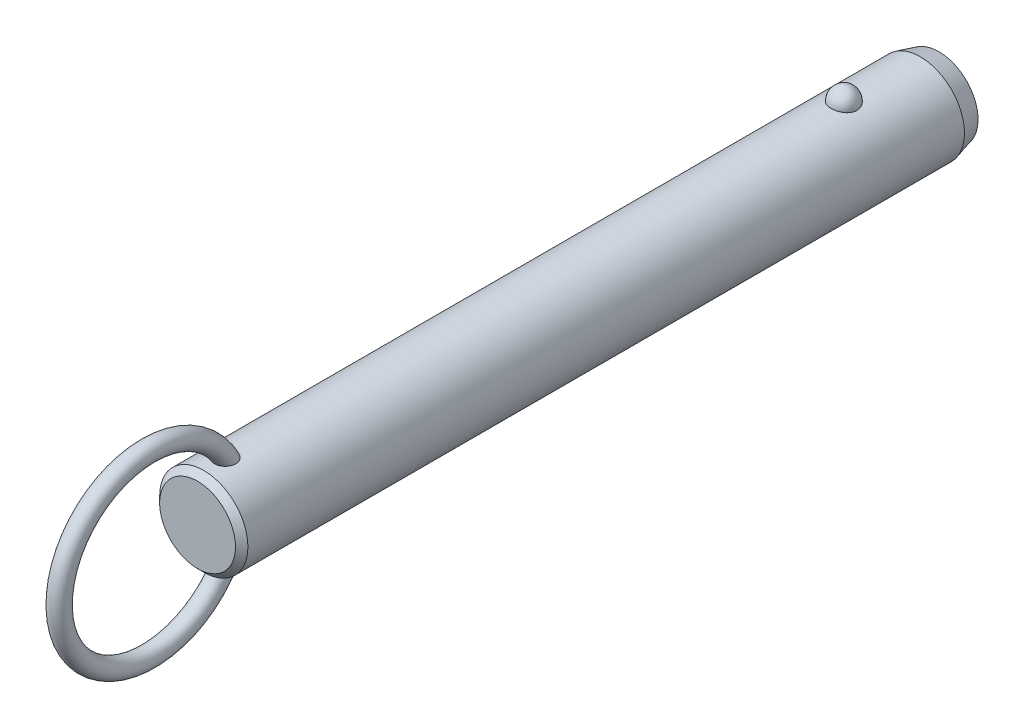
ISO-10303-21;
HEADER;
FILE_DESCRIPTION(('STEP AP214'),'2;1');
FILE_NAME('part.step','',(''),(''),'','','');
FILE_SCHEMA(('AUTOMOTIVE_DESIGN { 1 0 10303 214 1 1 1 1 }'));
ENDSEC;
DATA;
#1=APPLICATION_CONTEXT('core data for automotive mechanical design processes');
#2=APPLICATION_PROTOCOL_DEFINITION('international standard','automotive_design',2000,#1);
#3=PRODUCT_CONTEXT('',#1,'mechanical');
#4=PRODUCT('Part','Part','',(#3));
#5=PRODUCT_RELATED_PRODUCT_CATEGORY('part','',(#4));
#6=PRODUCT_DEFINITION_FORMATION('','',#4);
#7=PRODUCT_DEFINITION_CONTEXT('part definition',#1,'design');
#8=PRODUCT_DEFINITION('design','',#6,#7);
#9=PRODUCT_DEFINITION_SHAPE('','',#8);
#10=(LENGTH_UNIT() NAMED_UNIT(*) SI_UNIT(.MILLI.,.METRE.));
#11=(NAMED_UNIT(*) PLANE_ANGLE_UNIT() SI_UNIT($,.RADIAN.));
#12=(NAMED_UNIT(*) SI_UNIT($,.STERADIAN.) SOLID_ANGLE_UNIT());
#13=UNCERTAINTY_MEASURE_WITH_UNIT(LENGTH_MEASURE(1.E-05),#10,'distance_accuracy_value','');
#14=(GEOMETRIC_REPRESENTATION_CONTEXT(3) GLOBAL_UNCERTAINTY_ASSIGNED_CONTEXT((#13)) GLOBAL_UNIT_ASSIGNED_CONTEXT((#10,
#11,#12)) REPRESENTATION_CONTEXT('',''));
#15=CARTESIAN_POINT('',(0.,0.,0.));
#16=DIRECTION('',(0.,0.,1.));
#17=DIRECTION('',(1.,0.,0.));
#18=AXIS2_PLACEMENT_3D('',#15,#16,#17);
#19=CARTESIAN_POINT('',(0.,0.,94.));
#20=DIRECTION('',(0.,0.,-1.));
#21=DIRECTION('',(-1.,0.,0.));
#22=AXIS2_PLACEMENT_3D('',#19,#20,#21);
#23=CYLINDRICAL_SURFACE('',#22,7.1);
#24=CARTESIAN_POINT('',(2.0769088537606,6.78943661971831,-2.1));
#25=CARTESIAN_POINT('',(2.07690739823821,6.78943796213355,-1.98268154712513));
#26=CARTESIAN_POINT('',(2.06738130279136,6.79237331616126,-1.86534506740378));
#27=CARTESIAN_POINT('',(2.0295040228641,6.8037853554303,-1.63400788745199));
#28=CARTESIAN_POINT('',(2.00114757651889,6.81226358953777,-1.52000812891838));
#29=CARTESIAN_POINT('',(1.92632025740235,6.83379798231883,-1.29863433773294));
#30=CARTESIAN_POINT('',(1.87985726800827,6.84685214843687,-1.19125744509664));
#31=CARTESIAN_POINT('',(1.76995205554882,6.87608091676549,-0.98604657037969));
#32=CARTESIAN_POINT('',(1.70650980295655,6.8922555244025,-0.88821260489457));
#33=CARTESIAN_POINT('',(1.5638119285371,6.92602930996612,-0.704242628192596));
#34=CARTESIAN_POINT('',(1.4844714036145,6.94363582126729,-0.618173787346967));
#35=CARTESIAN_POINT('',(1.31221746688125,6.97823658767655,-0.460740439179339));
#36=CARTESIAN_POINT('',(1.21930409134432,6.99523084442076,-0.389375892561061));
#37=CARTESIAN_POINT('',(1.02268781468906,7.02666176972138,-0.263547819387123));
#38=CARTESIAN_POINT('',(0.91902009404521,7.04110638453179,-0.209031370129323));
#39=CARTESIAN_POINT('',(0.703548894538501,7.06588726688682,-0.118163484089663));
#40=CARTESIAN_POINT('',(0.591746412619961,7.07622403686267,-0.0818098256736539));
#41=CARTESIAN_POINT('',(0.365557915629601,7.09147068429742,-0.0288711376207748));
#42=CARTESIAN_POINT('',(0.251267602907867,7.09648447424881,-0.0119070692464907));
#43=CARTESIAN_POINT('',(0.0213499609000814,7.10089837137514,0.00304925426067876));
#44=CARTESIAN_POINT('',(-0.0942772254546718,7.10029907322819,0.00104351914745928));
#45=CARTESIAN_POINT('',(-0.321651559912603,7.09360829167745,-0.0216931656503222));
#46=CARTESIAN_POINT('',(-0.433431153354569,7.08760388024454,-0.0421272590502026));
#47=CARTESIAN_POINT('',(-0.651862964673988,7.07086131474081,-0.100729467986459));
#48=CARTESIAN_POINT('',(-0.758515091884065,7.06012307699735,-0.138897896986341));
#49=CARTESIAN_POINT('',(-0.964449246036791,7.03496097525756,-0.232213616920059));
#50=CARTESIAN_POINT('',(-1.06368095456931,7.02051445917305,-0.287465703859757));
#51=CARTESIAN_POINT('',(-1.25145353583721,6.98948740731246,-0.413383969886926));
#52=CARTESIAN_POINT('',(-1.33999321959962,6.97290663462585,-0.48405186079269));
#53=CARTESIAN_POINT('',(-1.50591604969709,6.93898770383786,-0.640594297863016));
#54=CARTESIAN_POINT('',(-1.58302488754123,6.92164094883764,-0.726757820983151));
#55=CARTESIAN_POINT('',(-1.72189320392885,6.8884103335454,-0.91092752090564));
#56=CARTESIAN_POINT('',(-1.78365144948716,6.87252659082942,-1.008934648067));
#57=CARTESIAN_POINT('',(-1.89101272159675,6.84377189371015,-1.21549497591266));
#58=CARTESIAN_POINT('',(-1.93639553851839,6.83094274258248,-1.32416860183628));
#59=CARTESIAN_POINT('',(-2.00874275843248,6.81002070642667,-1.54791500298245));
#60=CARTESIAN_POINT('',(-2.03570774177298,6.80192767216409,-1.66298757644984));
#61=CARTESIAN_POINT('',(-2.07047276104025,6.7914266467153,-1.89571453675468));
#62=CARTESIAN_POINT('',(-2.07835878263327,6.78899315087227,-2.01335491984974));
#63=CARTESIAN_POINT('',(-2.07502083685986,6.79001409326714,-2.24833570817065));
#64=CARTESIAN_POINT('',(-2.06379746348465,6.7934683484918,-2.36567612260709));
#65=CARTESIAN_POINT('',(-2.02263913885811,6.80583442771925,-2.59603194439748));
#66=CARTESIAN_POINT('',(-1.99281127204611,6.81471501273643,-2.70906820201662));
#67=CARTESIAN_POINT('',(-1.91526639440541,6.83691232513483,-2.92836575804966));
#68=CARTESIAN_POINT('',(-1.8675486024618,6.85022924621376,-3.03462676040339));
#69=CARTESIAN_POINT('',(-1.75504492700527,6.87991336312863,-3.23806487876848));
#70=CARTESIAN_POINT('',(-1.69015924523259,6.89629822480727,-3.33518422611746));
#71=CARTESIAN_POINT('',(-1.54505404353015,6.93024852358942,-3.51697105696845));
#72=CARTESIAN_POINT('',(-1.46483385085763,6.94781401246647,-3.60163799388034));
#73=CARTESIAN_POINT('',(-1.29071406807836,6.98225977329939,-3.75654119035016));
#74=CARTESIAN_POINT('',(-1.19675650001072,6.99913673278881,-3.82671308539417));
#75=CARTESIAN_POINT('',(-0.997940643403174,7.03023618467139,-3.9501837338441));
#76=CARTESIAN_POINT('',(-0.89308318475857,7.04445887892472,-4.00348377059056));
#77=CARTESIAN_POINT('',(-0.676902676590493,7.06848365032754,-4.09107242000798));
#78=CARTESIAN_POINT('',(-0.565686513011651,7.0783430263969,-4.12560889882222));
#79=CARTESIAN_POINT('',(-0.338739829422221,7.09282534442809,-4.17575450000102));
#80=CARTESIAN_POINT('',(-0.223009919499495,7.09744899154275,-4.19136617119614));
#81=CARTESIAN_POINT('',(0.00707628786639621,7.10090930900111,-4.20307965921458));
#82=CARTESIAN_POINT('',(0.121410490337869,7.09986531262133,-4.19958377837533));
#83=CARTESIAN_POINT('',(0.347815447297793,7.092380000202,-4.17411564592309));
#84=CARTESIAN_POINT('',(0.459886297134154,7.08593891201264,-4.15214417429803));
#85=CARTESIAN_POINT('',(0.678084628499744,7.06838983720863,-4.09049562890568));
#86=CARTESIAN_POINT('',(0.784237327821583,7.05730369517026,-4.05090137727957));
#87=CARTESIAN_POINT('',(0.988305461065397,7.03163139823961,-3.95511447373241));
#88=CARTESIAN_POINT('',(1.08622031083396,7.01704499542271,-3.89892064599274));
#89=CARTESIAN_POINT('',(1.27284490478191,6.98562668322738,-3.77035541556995));
#90=CARTESIAN_POINT('',(1.36137372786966,6.96876135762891,-3.69772964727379));
#91=CARTESIAN_POINT('',(1.52509486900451,6.93477412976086,-3.53878279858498));
#92=CARTESIAN_POINT('',(1.60028496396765,6.91765218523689,-3.45245943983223));
#93=CARTESIAN_POINT('',(1.73681688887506,6.88465753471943,-3.26658774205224));
#94=CARTESIAN_POINT('',(1.79785966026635,6.86881574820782,-3.16681408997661));
#95=CARTESIAN_POINT('',(1.90265327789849,6.84053157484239,-2.95814408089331));
#96=CARTESIAN_POINT('',(1.94640861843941,6.82808830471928,-2.84925010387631));
#97=CARTESIAN_POINT('',(2.01274378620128,6.80881460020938,-2.63454318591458));
#98=CARTESIAN_POINT('',(2.03676193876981,6.80160856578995,-2.52920574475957));
#99=CARTESIAN_POINT('',(2.06884490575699,6.79191902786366,-2.3159172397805));
#100=CARTESIAN_POINT('',(2.07691019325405,6.78943538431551,-2.20796625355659));
#101=CARTESIAN_POINT('',(2.0769088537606,6.78943661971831,-2.1));
#102=B_SPLINE_CURVE_WITH_KNOTS('',3,(#24,#25,#26,#27,#28,#29,#30,#31,#32,#33,#34,#35,#36,#37,
#38,#39,#40,#41,#42,#43,#44,#45,#46,#47,#48,#49,#50,#51,#52,#53,#54,#55,#56,#57,#58,#59,#60,#61,
#62,#63,#64,#65,#66,#67,#68,#69,#70,#71,#72,#73,#74,#75,#76,#77,#78,#79,#80,#81,#82,#83,#84,#85,
#86,#87,#88,#89,#90,#91,#92,#93,#94,#95,#96,#97,#98,#99,#100,#101),.UNSPECIFIED.,.T.,.F.,(4,2,2,
2,2,2,2,2,2,2,2,2,2,2,2,2,2,2,2,2,2,2,2,2,2,2,2,2,2,2,2,2,2,2,2,2,2,2,4),(0.,0.351568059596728,
0.703234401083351,1.05474780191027,1.40626181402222,1.75970563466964,2.11314851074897,
2.4654696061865,2.81774759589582,3.16301449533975,3.50824481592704,3.84801136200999,
4.18778391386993,4.52968352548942,4.87162112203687,5.22076181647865,5.56993054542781,
5.92363364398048,6.27732559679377,6.62942052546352,6.98150450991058,7.33158042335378,
7.68167162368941,8.03384443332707,8.38603269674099,8.73975272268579,9.09344583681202,
9.44234545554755,9.79119807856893,10.1327344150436,10.4742563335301,10.8141898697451,
11.1541474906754,11.4997793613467,11.8454687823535,12.1979079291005,12.5502553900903,
12.8738073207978,13.1973496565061),.UNSPECIFIED.);
#103=CARTESIAN_POINT('',(2.0769088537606,6.78943661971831,-2.1));
#104=VERTEX_POINT('',#103);
#105=EDGE_CURVE('E41',#104,#104,#102,.T.);
#106=ORIENTED_EDGE('',*,*,#105,.T.);
#107=EDGE_LOOP('',(#106));
#108=FACE_BOUND('',#107,.T.);
#109=CARTESIAN_POINT('',(0.,0.,100.92));
#110=DIRECTION('',(0.,0.,1.));
#111=DIRECTION('',(1.,0.,0.));
#112=AXIS2_PLACEMENT_3D('',#109,#110,#111);
#113=CIRCLE('',#112,7.1);
#114=CARTESIAN_POINT('',(7.1,0.,100.92));
#115=VERTEX_POINT('',#114);
#116=EDGE_CURVE('E10',#115,#115,#113,.F.);
#117=ORIENTED_EDGE('',*,*,#116,.T.);
#118=EDGE_LOOP('',(#117));
#119=FACE_BOUND('',#118,.T.);
#120=CARTESIAN_POINT('',(-0.429539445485,-7.08699541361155,95.7429212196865));
#121=CARTESIAN_POINT('',(-0.508331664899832,-7.08221999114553,95.7668764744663));
#122=CARTESIAN_POINT('',(-0.58503984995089,-7.07624016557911,95.7974570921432));
#123=CARTESIAN_POINT('',(-0.732082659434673,-7.06254296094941,95.8710242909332));
#124=CARTESIAN_POINT('',(-0.802417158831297,-7.05482554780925,95.9140111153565));
#125=CARTESIAN_POINT('',(-0.934722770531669,-7.03851844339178,96.0111135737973));
#126=CARTESIAN_POINT('',(-0.99670020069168,-7.02992941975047,96.0652207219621));
#127=CARTESIAN_POINT('',(-1.11079942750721,-7.01280697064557,96.1829676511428));
#128=CARTESIAN_POINT('',(-1.16292136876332,-7.00427354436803,96.2466072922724));
#129=CARTESIAN_POINT('',(-1.25705660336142,-6.98799959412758,96.3826870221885));
#130=CARTESIAN_POINT('',(-1.29888032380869,-6.98027525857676,96.4552598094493));
#131=CARTESIAN_POINT('',(-1.37069920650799,-6.96652886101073,96.6061686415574));
#132=CARTESIAN_POINT('',(-1.40069157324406,-6.96050720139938,96.6845060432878));
#133=CARTESIAN_POINT('',(-1.45043507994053,-6.95031881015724,96.8501903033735));
#134=CARTESIAN_POINT('',(-1.46937115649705,-6.94630231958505,96.9377897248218));
#135=CARTESIAN_POINT('',(-1.49424917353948,-6.94099239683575,97.1148714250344));
#136=CARTESIAN_POINT('',(-1.50018601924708,-6.93970003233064,97.2043544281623));
#137=CARTESIAN_POINT('',(-1.49978214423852,-6.93978815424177,97.3940607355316));
#138=CARTESIAN_POINT('',(-1.49187639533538,-6.94150934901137,97.494279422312));
#139=CARTESIAN_POINT('',(-1.46177925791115,-6.94790814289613,97.6924798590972));
#140=CARTESIAN_POINT('',(-1.43957541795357,-6.95258831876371,97.790459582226));
#141=CARTESIAN_POINT('',(-1.37783293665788,-6.96510647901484,97.9953629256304));
#142=CARTESIAN_POINT('',(-1.33634073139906,-6.97328848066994,98.1016801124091));
#143=CARTESIAN_POINT('',(-1.23686994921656,-6.99161706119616,98.3061777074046));
#144=CARTESIAN_POINT('',(-1.17889192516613,-7.00176357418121,98.4043583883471));
#145=CARTESIAN_POINT('',(-1.0587512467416,-7.02082898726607,98.5723743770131));
#146=CARTESIAN_POINT('',(-0.999247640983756,-7.02963746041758,98.6441230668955));
#147=CARTESIAN_POINT('',(-0.869494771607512,-7.04686074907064,98.7771959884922));
#148=CARTESIAN_POINT('',(-0.799263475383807,-7.05527619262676,98.8385372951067));
#149=CARTESIAN_POINT('',(-0.665408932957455,-7.06899457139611,98.9351316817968));
#150=CARTESIAN_POINT('',(-0.603817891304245,-7.07457275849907,98.9731512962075));
#151=CARTESIAN_POINT('',(-0.47517283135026,-7.08437420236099,99.0387581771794));
#152=CARTESIAN_POINT('',(-0.408123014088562,-7.08859848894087,99.0663533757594));
#153=CARTESIAN_POINT('',(-0.269431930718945,-7.09522749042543,99.1092569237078));
#154=CARTESIAN_POINT('',(-0.197757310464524,-7.09761688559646,99.1244618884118));
#155=CARTESIAN_POINT('',(-0.0527849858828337,-7.10017268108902,99.1407168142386));
#156=CARTESIAN_POINT('',(0.0205115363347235,-7.10034065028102,99.1417767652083));
#157=CARTESIAN_POINT('',(0.156426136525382,-7.09855986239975,99.1304619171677));
#158=CARTESIAN_POINT('',(0.219199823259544,-7.09688191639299,99.1198060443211));
#159=CARTESIAN_POINT('',(0.342134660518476,-7.09201880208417,99.0885379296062));
#160=CARTESIAN_POINT('',(0.402295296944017,-7.08883333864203,99.0679237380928));
#161=CARTESIAN_POINT('',(0.520687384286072,-7.08113868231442,99.0172125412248));
#162=CARTESIAN_POINT('',(0.578791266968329,-7.07658958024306,98.9868272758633));
#163=CARTESIAN_POINT('',(0.690173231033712,-7.06659708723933,98.9183678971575));
#164=CARTESIAN_POINT('',(0.743447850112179,-7.061153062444,98.8802883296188));
#165=CARTESIAN_POINT('',(0.870947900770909,-7.04680292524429,98.7765929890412));
#166=CARTESIAN_POINT('',(0.941828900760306,-7.0375580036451,98.7068972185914));
#167=CARTESIAN_POINT('',(1.07136606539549,-7.01900793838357,98.5569450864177));
#168=CARTESIAN_POINT('',(1.13000013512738,-7.00970271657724,98.4766700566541));
#169=CARTESIAN_POINT('',(1.23579584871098,-6.99183327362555,98.3068997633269));
#170=CARTESIAN_POINT('',(1.2827427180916,-6.98328455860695,98.2172696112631));
#171=CARTESIAN_POINT('',(1.36351442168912,-6.96796352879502,98.0321763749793));
#172=CARTESIAN_POINT('',(1.39733971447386,-6.96119115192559,97.9367134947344));
#173=CARTESIAN_POINT('',(1.45579181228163,-6.94922464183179,97.7253092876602));
#174=CARTESIAN_POINT('',(1.47790145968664,-6.94449000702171,97.608631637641));
#175=CARTESIAN_POINT('',(1.50168752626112,-6.93938731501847,97.3730153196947));
#176=CARTESIAN_POINT('',(1.50336085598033,-6.93901991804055,97.2540763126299));
#177=CARTESIAN_POINT('',(1.48486516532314,-6.9430010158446,97.0236079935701));
#178=CARTESIAN_POINT('',(1.46573441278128,-6.9471253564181,96.911995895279));
#179=CARTESIAN_POINT('',(1.40606892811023,-6.95944667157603,96.6948868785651));
#180=CARTESIAN_POINT('',(1.36556446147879,-6.96763788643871,96.5893815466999));
#181=CARTESIAN_POINT('',(1.27082700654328,-6.98548038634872,96.4042879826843));
#182=CARTESIAN_POINT('',(1.21949810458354,-6.99473841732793,96.3231719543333));
#183=CARTESIAN_POINT('',(1.10242050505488,-7.01414069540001,96.1722278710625));
#184=CARTESIAN_POINT('',(1.03668119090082,-7.02428436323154,96.1023925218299));
#185=CARTESIAN_POINT('',(0.900559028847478,-7.04295285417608,95.9835735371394));
#186=CARTESIAN_POINT('',(0.83142884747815,-7.05153466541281,95.9331573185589));
#187=CARTESIAN_POINT('',(0.68529187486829,-7.06723150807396,95.8451429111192));
#188=CARTESIAN_POINT('',(0.608287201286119,-7.0743469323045,95.8075412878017));
#189=CARTESIAN_POINT('',(0.451878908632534,-7.08602232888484,95.7474915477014));
#190=CARTESIAN_POINT('',(0.372686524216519,-7.09067127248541,95.7245088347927));
#191=CARTESIAN_POINT('',(0.211477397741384,-7.09730788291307,95.6920357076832));
#192=CARTESIAN_POINT('',(0.129460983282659,-7.09929585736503,95.6825437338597));
#193=CARTESIAN_POINT('',(-0.0332905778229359,-7.10037858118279,95.6773517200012));
#194=CARTESIAN_POINT('',(-0.114016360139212,-7.09953334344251,95.6813656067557));
#195=CARTESIAN_POINT('',(-0.273670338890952,-7.09517338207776,95.7024540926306));
#196=CARTESIAN_POINT('',(-0.352598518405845,-7.09165863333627,95.7195288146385));
#197=CARTESIAN_POINT('',(-0.429539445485,-7.08699541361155,95.7429212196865));
#198=B_SPLINE_CURVE_WITH_KNOTS('',3,(#120,#121,#122,#123,#124,#125,#126,#127,#128,#129,#130,
#131,#132,#133,#134,#135,#136,#137,#138,#139,#140,#141,#142,#143,#144,#145,#146,#147,#148,#149,
#150,#151,#152,#153,#154,#155,#156,#157,#158,#159,#160,#161,#162,#163,#164,#165,#166,#167,#168,
#169,#170,#171,#172,#173,#174,#175,#176,#177,#178,#179,#180,#181,#182,#183,#184,#185,#186,#187,
#188,#189,#190,#191,#192,#193,#194,#195,#196,#197),.UNSPECIFIED.,.T.,.F.,(4,2,2,2,2,2,2,2,2,2,2,
2,2,2,2,2,2,2,2,2,2,2,2,2,2,2,2,2,2,2,2,2,2,2,2,2,2,2,4),(0.,0.247183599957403,
0.494372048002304,0.741372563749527,0.988369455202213,1.23962059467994,1.49093106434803,
1.75897818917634,2.02713035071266,2.32758265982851,2.62829697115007,2.97008736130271,
3.31186629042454,3.59175319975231,3.87117637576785,4.08813841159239,4.30493502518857,
4.52352259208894,4.74195577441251,4.9321532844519,5.12238804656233,5.31884850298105,
5.51544871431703,5.81332317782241,6.11173048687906,6.4152726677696,6.71880423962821,
7.07358156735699,7.42841252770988,7.76631485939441,8.10373999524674,8.39142246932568,
8.67891817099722,8.93560332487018,9.19221962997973,9.43881106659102,9.68537399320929,
9.92674752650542,10.1681233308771),.UNSPECIFIED.);
#199=CARTESIAN_POINT('',(-0.429539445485,-7.08699541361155,95.7429212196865));
#200=VERTEX_POINT('',#199);
#201=EDGE_CURVE('E59',#200,#200,#198,.T.);
#202=ORIENTED_EDGE('',*,*,#201,.T.);
#203=EDGE_LOOP('',(#202));
#204=FACE_BOUND('',#203,.T.);
#205=CARTESIAN_POINT('',(-0.429539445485,7.08699541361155,95.7429212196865));
#206=CARTESIAN_POINT('',(-0.351665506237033,7.09171429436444,95.7192469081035));
#207=CARTESIAN_POINT('',(-0.271733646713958,7.09525896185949,95.7020369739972));
#208=CARTESIAN_POINT('',(-0.110026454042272,7.09960839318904,95.6810059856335));
#209=CARTESIAN_POINT('',(-0.0282502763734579,7.10041187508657,95.677191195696));
#210=CARTESIAN_POINT('',(0.134782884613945,7.09918849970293,95.683059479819));
#211=CARTESIAN_POINT('',(0.21603995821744,7.09716214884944,95.6927401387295));
#212=CARTESIAN_POINT('',(0.375730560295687,7.09050177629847,95.7253471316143));
#213=CARTESIAN_POINT('',(0.454164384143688,7.08586802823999,95.7482720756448));
#214=CARTESIAN_POINT('',(0.60602533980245,7.07449911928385,95.806771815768));
#215=CARTESIAN_POINT('',(0.679451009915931,7.06776334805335,95.8423502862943));
#216=CARTESIAN_POINT('',(0.819234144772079,7.05292866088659,95.9251753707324));
#217=CARTESIAN_POINT('',(0.885591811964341,7.04482978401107,95.9724216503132));
#218=CARTESIAN_POINT('',(1.00993211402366,7.02808709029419,96.0775902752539));
#219=CARTESIAN_POINT('',(1.06785399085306,7.01943990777,96.135583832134));
#220=CARTESIAN_POINT('',(1.17342527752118,7.00256662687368,96.2603013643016));
#221=CARTESIAN_POINT('',(1.22107408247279,6.99434055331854,96.3270258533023));
#222=CARTESIAN_POINT('',(1.30652927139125,6.97889183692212,96.4693622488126));
#223=CARTESIAN_POINT('',(1.34399711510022,6.97170674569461,96.5451808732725));
#224=CARTESIAN_POINT('',(1.40682616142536,6.95930080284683,96.7018100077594));
#225=CARTESIAN_POINT('',(1.43218374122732,6.95408053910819,96.7826220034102));
#226=CARTESIAN_POINT('',(1.47246409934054,6.94566853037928,96.9535314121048));
#227=CARTESIAN_POINT('',(1.48642590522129,6.9426653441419,97.0438630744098));
#228=CARTESIAN_POINT('',(1.5011410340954,6.93949744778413,97.225619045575));
#229=CARTESIAN_POINT('',(1.50188917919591,6.93933385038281,97.3170437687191));
#230=CARTESIAN_POINT('',(1.49030464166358,6.94183245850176,97.5108438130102));
#231=CARTESIAN_POINT('',(1.47627413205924,6.94486147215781,97.613112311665));
#232=CARTESIAN_POINT('',(1.43356351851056,6.95380194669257,97.8144719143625));
#233=CARTESIAN_POINT('',(1.4048676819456,6.95971650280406,97.9135594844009));
#234=CARTESIAN_POINT('',(1.32908750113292,6.97461208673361,98.1189087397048));
#235=CARTESIAN_POINT('',(1.28011435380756,6.98388945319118,98.2244566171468));
#236=CARTESIAN_POINT('',(1.16520357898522,7.00397743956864,98.4257604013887));
#237=CARTESIAN_POINT('',(1.09927694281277,7.01478706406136,98.5215225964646));
#238=CARTESIAN_POINT('',(0.969361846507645,7.03373936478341,98.6767565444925));
#239=CARTESIAN_POINT('',(0.909042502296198,7.04187023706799,98.7393032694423));
#240=CARTESIAN_POINT('',(0.77917855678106,7.0574173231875,98.8540535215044));
#241=CARTESIAN_POINT('',(0.70964977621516,7.06483472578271,98.9062744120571));
#242=CARTESIAN_POINT('',(0.576854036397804,7.0767751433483,98.9881138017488));
#243=CARTESIAN_POINT('',(0.515118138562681,7.08158033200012,99.0201641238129));
#244=CARTESIAN_POINT('',(0.387127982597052,7.08972701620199,99.0737656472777));
#245=CARTESIAN_POINT('',(0.320877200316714,7.09306962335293,99.0953248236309));
#246=CARTESIAN_POINT('',(0.185041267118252,7.09791507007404,99.1264005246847));
#247=CARTESIAN_POINT('',(0.115437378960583,7.09940591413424,99.1358385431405));
#248=CARTESIAN_POINT('',(-0.0243157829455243,7.10030171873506,99.1415226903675));
#249=CARTESIAN_POINT('',(-0.0944648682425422,7.0997073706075,99.1377731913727));
#250=CARTESIAN_POINT('',(-0.225713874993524,7.09668414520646,99.1185081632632));
#251=CARTESIAN_POINT('',(-0.287006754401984,7.09444865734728,99.1042323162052));
#252=CARTESIAN_POINT('',(-0.40655537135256,7.08860360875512,99.0663685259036));
#253=CARTESIAN_POINT('',(-0.46480981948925,7.08499346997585,99.0427766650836));
#254=CARTESIAN_POINT('',(-0.594955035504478,7.07541654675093,98.9789232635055));
#255=CARTESIAN_POINT('',(-0.665389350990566,7.06906574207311,98.935753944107));
#256=CARTESIAN_POINT('',(-0.798242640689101,7.05530261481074,98.838587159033));
#257=CARTESIAN_POINT('',(-0.860645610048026,7.0478882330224,98.7845686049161));
#258=CARTESIAN_POINT('',(-0.994249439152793,7.03045217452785,98.6509965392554));
#259=CARTESIAN_POINT('',(-1.06260129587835,7.02030745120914,98.5686143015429));
#260=CARTESIAN_POINT('',(-1.18502045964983,7.00068382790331,98.393843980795));
#261=CARTESIAN_POINT('',(-1.23907684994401,6.99120544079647,98.301448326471));
#262=CARTESIAN_POINT('',(-1.33335589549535,6.97384343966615,98.1080085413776));
#263=CARTESIAN_POINT('',(-1.37336138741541,6.96598557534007,98.0068564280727));
#264=CARTESIAN_POINT('',(-1.43770677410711,6.9529905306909,97.7995046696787));
#265=CARTESIAN_POINT('',(-1.46204473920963,6.94785368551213,97.69330440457));
#266=CARTESIAN_POINT('',(-1.49537533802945,6.94076296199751,97.4682317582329));
#267=CARTESIAN_POINT('',(-1.50273564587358,6.93914842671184,97.3490975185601));
#268=CARTESIAN_POINT('',(-1.4954555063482,6.94072368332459,97.1114703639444));
#269=CARTESIAN_POINT('',(-1.48082914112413,6.94391040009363,96.9929770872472));
#270=CARTESIAN_POINT('',(-1.43076401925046,6.95438579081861,96.7734325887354));
#271=CARTESIAN_POINT('',(-1.39762227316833,6.96121852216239,96.6718413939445));
#272=CARTESIAN_POINT('',(-1.31211274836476,6.97783941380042,96.4773513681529));
#273=CARTESIAN_POINT('',(-1.2597660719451,6.98762432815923,96.3844431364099));
#274=CARTESIAN_POINT('',(-1.14583073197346,7.00713153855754,96.2241601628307));
#275=CARTESIAN_POINT('',(-1.0866594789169,7.01665982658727,96.1550351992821));
#276=CARTESIAN_POINT('',(-0.956606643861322,7.03556646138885,96.0288786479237));
#277=CARTESIAN_POINT('',(-0.885737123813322,7.04494495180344,95.9718347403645));
#278=CARTESIAN_POINT('',(-0.751558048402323,7.06035735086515,95.8831004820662));
#279=CARTESIAN_POINT('',(-0.690120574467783,7.0666695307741,95.8485932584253));
#280=CARTESIAN_POINT('',(-0.56281546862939,7.07794609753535,95.7887507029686));
#281=CARTESIAN_POINT('',(-0.496948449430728,7.08291067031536,95.7634141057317));
#282=CARTESIAN_POINT('',(-0.429539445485,7.08699541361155,95.7429212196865));
#283=B_SPLINE_CURVE_WITH_KNOTS('',3,(#205,#206,#207,#208,#209,#210,#211,#212,#213,#214,#215,
#216,#217,#218,#219,#220,#221,#222,#223,#224,#225,#226,#227,#228,#229,#230,#231,#232,#233,#234,
#235,#236,#237,#238,#239,#240,#241,#242,#243,#244,#245,#246,#247,#248,#249,#250,#251,#252,#253,
#254,#255,#256,#257,#258,#259,#260,#261,#262,#263,#264,#265,#266,#267,#268,#269,#270,#271,#272,
#273,#274,#275,#276,#277,#278,#279,#280,#281,#282),.UNSPECIFIED.,.T.,.F.,(4,2,2,2,2,2,2,2,2,2,2,
2,2,2,2,2,2,2,2,2,2,2,2,2,2,2,2,2,2,2,2,2,2,2,2,2,2,2,4),(0.,0.244335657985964,
0.488785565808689,0.733191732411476,0.977572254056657,1.22202379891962,1.46646834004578,
1.71259457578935,1.95873529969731,2.21226768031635,2.46587585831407,2.7391381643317,
3.01250754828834,3.32109936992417,3.63002293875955,3.97863512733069,4.32702187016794,
4.5879394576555,4.84841449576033,5.05676704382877,5.26496096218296,5.47449661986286,
5.68396281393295,5.87205447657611,6.06022532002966,6.30743751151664,6.55513496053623,
6.87602468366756,7.19715875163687,7.52305774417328,7.84899686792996,8.20516155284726,
8.56109821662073,8.8804008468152,9.19935367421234,9.47236282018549,9.74509220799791,
9.95662250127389,10.1681235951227),.UNSPECIFIED.);
#284=CARTESIAN_POINT('',(-0.429539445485,7.08699541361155,95.7429212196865));
#285=VERTEX_POINT('',#284);
#286=EDGE_CURVE('E66',#285,#285,#283,.T.);
#287=ORIENTED_EDGE('',*,*,#286,.T.);
#288=EDGE_LOOP('',(#287));
#289=FACE_BOUND('',#288,.T.);
#290=CARTESIAN_POINT('',(0.,0.,-14.4));
#291=DIRECTION('',(0.,0.,-1.));
#292=DIRECTION('',(-1.,0.,0.));
#293=AXIS2_PLACEMENT_3D('',#290,#291,#292);
#294=CIRCLE('',#293,7.1);
#295=CARTESIAN_POINT('',(-7.1,0.,-14.4));
#296=VERTEX_POINT('',#295);
#297=EDGE_CURVE('E56',#296,#296,#294,.F.);
#298=ORIENTED_EDGE('',*,*,#297,.T.);
#299=EDGE_LOOP('',(#298));
#300=FACE_BOUND('',#299,.T.);
#301=ADVANCED_FACE('F37',(#108,#119,#204,#289,#300),#23,.T.);
#302=CARTESIAN_POINT('',(0.,0.,-17.4));
#303=DIRECTION('',(0.,0.,-1.));
#304=DIRECTION('',(-1.,0.,0.));
#305=AXIS2_PLACEMENT_3D('',#302,#303,#304);
#306=PLANE('',#305);
#307=CARTESIAN_POINT('',(0.,0.,-17.4));
#308=DIRECTION('',(0.,0.,-1.));
#309=DIRECTION('',(-1.,0.,0.));
#310=AXIS2_PLACEMENT_3D('',#307,#308,#309);
#311=CIRCLE('',#310,6.29615242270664);
#312=CARTESIAN_POINT('',(-6.29615242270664,0.,-17.4));
#313=VERTEX_POINT('',#312);
#314=EDGE_CURVE('E65',#313,#313,#311,.T.);
#315=ORIENTED_EDGE('',*,*,#314,.T.);
#316=EDGE_LOOP('',(#315));
#317=FACE_BOUND('',#316,.T.);
#318=ADVANCED_FACE('F84',(#317),#306,.T.);
#319=CARTESIAN_POINT('',(0.,0.,-17.4));
#320=DIRECTION('',(0.,0.,1.));
#321=DIRECTION('',(1.,0.,0.));
#322=AXIS2_PLACEMENT_3D('',#319,#320,#321);
#323=CONICAL_SURFACE('',#322,6.29615242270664,0.261799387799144);
#324=ORIENTED_EDGE('',*,*,#297,.F.);
#325=EDGE_LOOP('',(#324));
#326=FACE_BOUND('',#325,.T.);
#327=ORIENTED_EDGE('',*,*,#314,.F.);
#328=EDGE_LOOP('',(#327));
#329=FACE_BOUND('',#328,.T.);
#330=ADVANCED_FACE('F82',(#326,#329),#323,.T.);
#331=CARTESIAN_POINT('',(0.,0.,101.92));
#332=DIRECTION('',(0.,0.,1.));
#333=DIRECTION('',(1.,0.,0.));
#334=AXIS2_PLACEMENT_3D('',#331,#332,#333);
#335=PLANE('',#334);
#336=CARTESIAN_POINT('',(0.,0.,101.92));
#337=DIRECTION('',(0.,0.,1.));
#338=DIRECTION('',(1.,0.,0.));
#339=AXIS2_PLACEMENT_3D('',#336,#337,#338);
#340=CIRCLE('',#339,6.10000000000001);
#341=CARTESIAN_POINT('',(6.10000000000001,0.,101.92));
#342=VERTEX_POINT('',#341);
#343=EDGE_CURVE('E50',#342,#342,#340,.T.);
#344=ORIENTED_EDGE('',*,*,#343,.T.);
#345=EDGE_LOOP('',(#344));
#346=FACE_BOUND('',#345,.T.);
#347=ADVANCED_FACE('F76',(#346),#335,.T.);
#348=CARTESIAN_POINT('',(0.,0.,109.85));
#349=DIRECTION('',(1.,0.,0.));
#350=DIRECTION('',(0.,0.,-1.));
#351=AXIS2_PLACEMENT_3D('',#348,#349,#350);
#352=TOROIDAL_SURFACE('',#351,14.35,1.5);
#353=ORIENTED_EDGE('',*,*,#286,.F.);
#354=EDGE_LOOP('',(#353));
#355=FACE_BOUND('',#354,.T.);
#356=ORIENTED_EDGE('',*,*,#201,.F.);
#357=EDGE_LOOP('',(#356));
#358=FACE_BOUND('',#357,.T.);
#359=ADVANCED_FACE('F72',(#355,#358),#352,.T.);
#360=CARTESIAN_POINT('',(0.,0.,101.92));
#361=DIRECTION('',(0.,0.,-1.));
#362=DIRECTION('',(-1.,0.,0.));
#363=AXIS2_PLACEMENT_3D('',#360,#361,#362);
#364=CONICAL_SURFACE('',#363,6.10000000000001,0.78539816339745);
#365=ORIENTED_EDGE('',*,*,#116,.F.);
#366=EDGE_LOOP('',(#365));
#367=FACE_BOUND('',#366,.T.);
#368=ORIENTED_EDGE('',*,*,#343,.F.);
#369=EDGE_LOOP('',(#368));
#370=FACE_BOUND('',#369,.T.);
#371=ADVANCED_FACE('F39',(#367,#370),#364,.T.);
#372=CARTESIAN_POINT('',(0.,7.1,-2.1));
#373=DIRECTION('',(0.,1.,0.));
#374=DIRECTION('',(0.,0.,1.));
#375=AXIS2_PLACEMENT_3D('',#372,#373,#374);
#376=SPHERICAL_SURFACE('',#375,2.10000000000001);
#377=ORIENTED_EDGE('',*,*,#105,.F.);
#378=EDGE_LOOP('',(#377));
#379=FACE_BOUND('',#378,.T.);
#380=ADVANCED_FACE('F78',(#379),#376,.T.);
#381=CLOSED_SHELL('',(#301,#318,#330,#347,#359,#371,#380));
#382=MANIFOLD_SOLID_BREP('B2',#381);
#383=ADVANCED_BREP_SHAPE_REPRESENTATION('',(#18,#382),#14);
#384=SHAPE_DEFINITION_REPRESENTATION(#9,#383);
ENDSEC;
END-ISO-10303-21;
